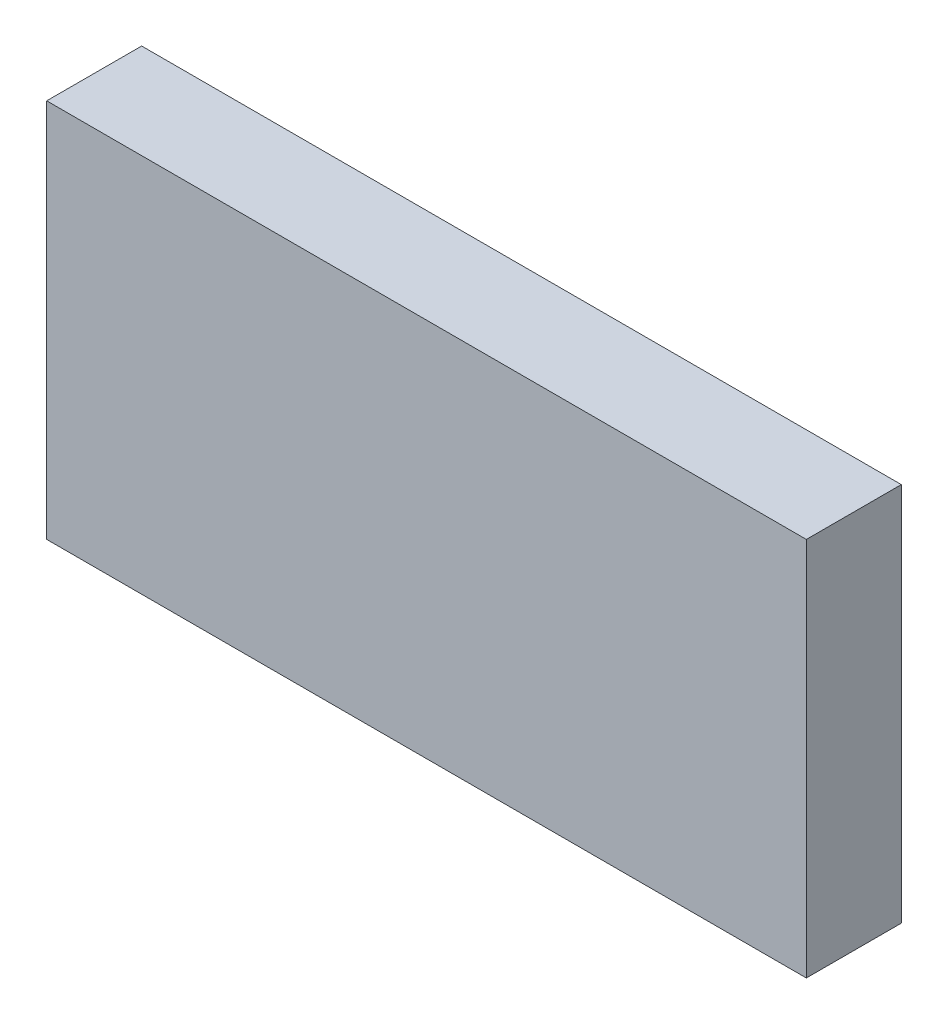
from build123d import *

# Parameters (mm, degrees)
SKETCH1_W      = 50.8
SKETCH1_H      = 25.4
EXTRUDE1_DEPTH = 6.35


with BuildPart() as part:
    # Sketch1 → Extrude1 (new body)
    with BuildSketch(Plane.XY):
        Rectangle(SKETCH1_W, SKETCH1_H)
    extrude(amount=EXTRUDE1_DEPTH)


solid = part.part
